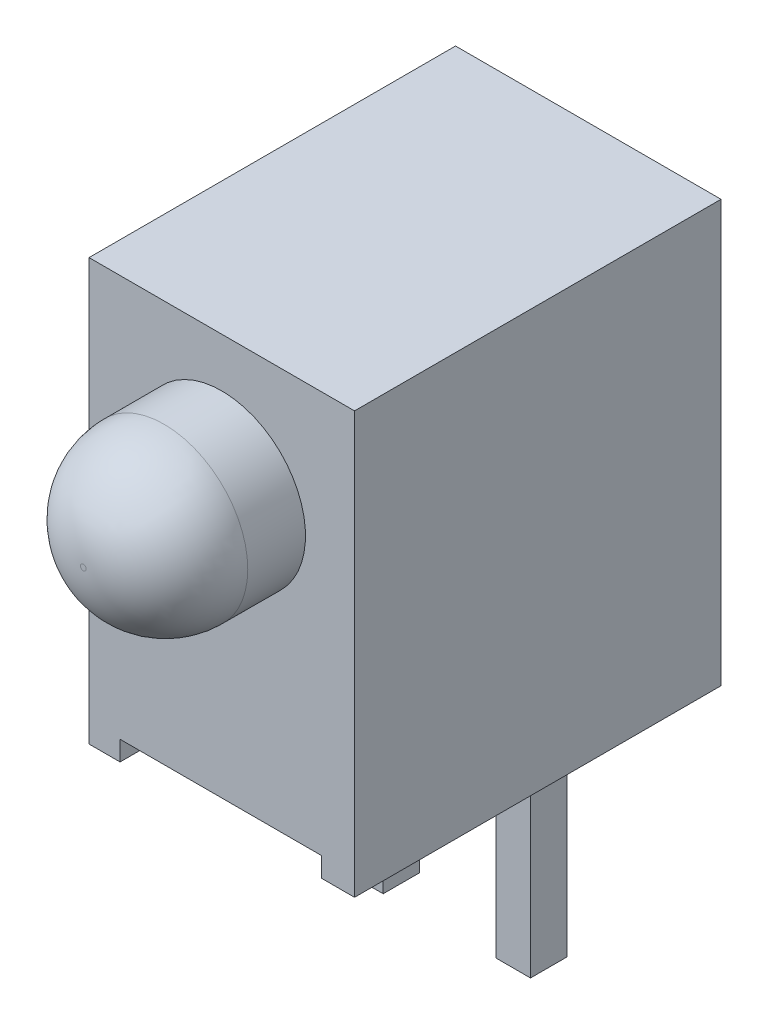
from build123d import *

# Parameters (mm, degrees)
SKETCH1_W           = 4.6
SKETCH1_H           = 6.35
BOSS_EXTRUDE1_DEPTH = 7.3
SKETCH2_R           = 1.45
BOSS_EXTRUDE2_DEPTH = 2.4
FILLET2_R           = 1.4
SKETCH4_W           = 3.493828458
SKETCH4_H           = 0.340679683
CUT_EXTRUDE1_DEPTH  = 10.944973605
SKETCH6_W           = 0.6
SKETCH6_H           = 0.632779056
BOSS_EXTRUDE5_DEPTH = 3.81


with BuildPart() as part:
    # Sketch1 → Boss-Extrude1 (new body)
    with BuildSketch(Plane(origin=(0, 0, 0), x_dir=(1, 0, 0), z_dir=(0, 1, 0))):
        Rectangle(SKETCH1_W, SKETCH1_H)
    extrude(amount=BOSS_EXTRUDE1_DEPTH)

    # Sketch2 → Boss-Extrude2 (add)
    with BuildSketch(Plane.XY.offset(3.175)):
        with Locations(Location((0, 5, 0), (0, 0, 180))):
            Circle(SKETCH2_R)
    extrude(amount=BOSS_EXTRUDE2_DEPTH)

    # Fillet2
    fillet2_edges = [part.edges().sort_by_distance(p)[0] for p in [
        (1.45, 5, 5.575),
    ]]
    fillet(fillet2_edges, radius=FILLET2_R)

    # Sketch4 → Cut-Extrude1 (cut, through all)
    with BuildSketch(Plane.XY.offset(3.175)):
        with Locations((-0.015737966, 0.170339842)):
            Rectangle(SKETCH4_W, SKETCH4_H)
    extrude(amount=-CUT_EXTRUDE1_DEPTH, mode=Mode.SUBTRACT)

    # Sketch6 → Boss-Extrude5 (add)
    with BuildSketch(Plane.XZ.offset(-0.340679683)):
        with Locations((-1.274553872, -0.912409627)):
            Rectangle(SKETCH6_W, SKETCH6_H)
        with Locations((1.265446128, -0.925)):
            Rectangle(SKETCH6_W, SKETCH6_H)
    extrude(amount=BOSS_EXTRUDE5_DEPTH)


solid = part.part
